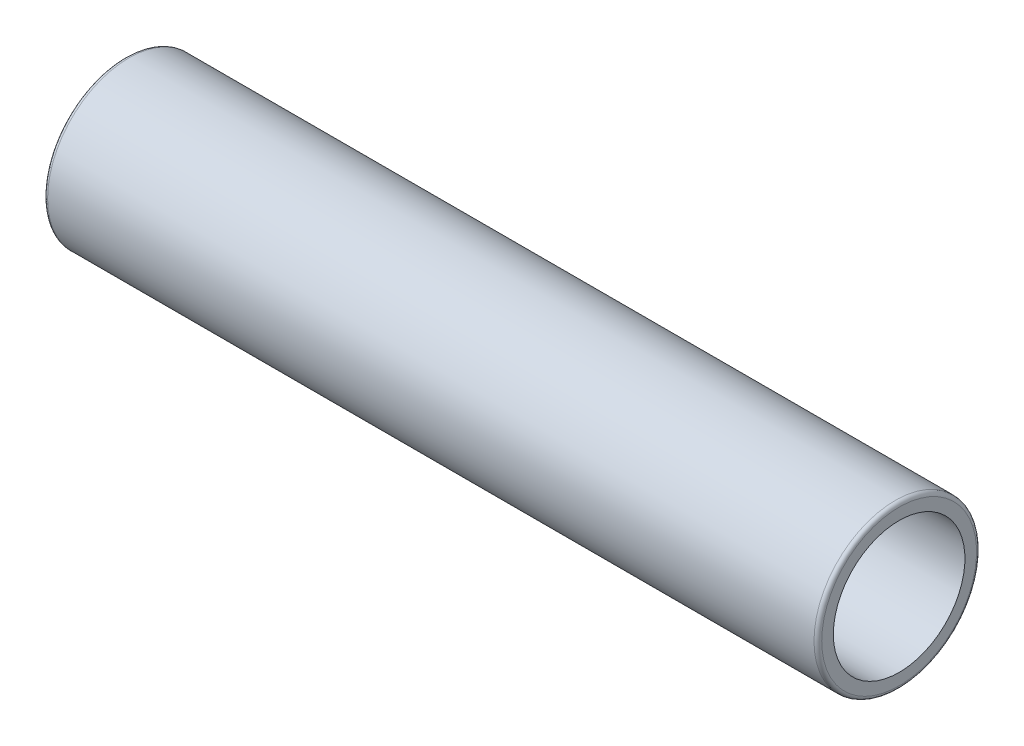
ISO-10303-21;
HEADER;
FILE_DESCRIPTION(('STEP AP214'),'2;1');
FILE_NAME('part.step','',(''),(''),'','','');
FILE_SCHEMA(('AUTOMOTIVE_DESIGN { 1 0 10303 214 1 1 1 1 }'));
ENDSEC;
DATA;
#1=APPLICATION_CONTEXT('core data for automotive mechanical design processes');
#2=APPLICATION_PROTOCOL_DEFINITION('international standard','automotive_design',2000,#1);
#3=PRODUCT_CONTEXT('',#1,'mechanical');
#4=PRODUCT('Part','Part','',(#3));
#5=PRODUCT_RELATED_PRODUCT_CATEGORY('part','',(#4));
#6=PRODUCT_DEFINITION_FORMATION('','',#4);
#7=PRODUCT_DEFINITION_CONTEXT('part definition',#1,'design');
#8=PRODUCT_DEFINITION('design','',#6,#7);
#9=PRODUCT_DEFINITION_SHAPE('','',#8);
#10=(LENGTH_UNIT() NAMED_UNIT(*) SI_UNIT(.MILLI.,.METRE.));
#11=(NAMED_UNIT(*) PLANE_ANGLE_UNIT() SI_UNIT($,.RADIAN.));
#12=(NAMED_UNIT(*) SI_UNIT($,.STERADIAN.) SOLID_ANGLE_UNIT());
#13=UNCERTAINTY_MEASURE_WITH_UNIT(LENGTH_MEASURE(1.E-05),#10,'distance_accuracy_value','');
#14=(GEOMETRIC_REPRESENTATION_CONTEXT(3) GLOBAL_UNCERTAINTY_ASSIGNED_CONTEXT((#13)) GLOBAL_UNIT_ASSIGNED_CONTEXT((#10,
#11,#12)) REPRESENTATION_CONTEXT('',''));
#15=CARTESIAN_POINT('',(0.,0.,0.));
#16=DIRECTION('',(0.,0.,1.));
#17=DIRECTION('',(1.,0.,0.));
#18=AXIS2_PLACEMENT_3D('',#15,#16,#17);
#19=CARTESIAN_POINT('',(0.,0.,0.));
#20=DIRECTION('',(-1.,0.,0.));
#21=DIRECTION('',(0.,0.,1.));
#22=AXIS2_PLACEMENT_3D('',#19,#20,#21);
#23=CYLINDRICAL_SURFACE('',#22,6.);
#24=CARTESIAN_POINT('',(1.9999999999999,0.,0.));
#25=DIRECTION('',(-1.,0.,0.));
#26=DIRECTION('',(0.,0.,1.));
#27=AXIS2_PLACEMENT_3D('',#24,#25,#26);
#28=CIRCLE('',#27,6.);
#29=CARTESIAN_POINT('',(1.9999999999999,0.,6.));
#30=VERTEX_POINT('',#29);
#31=EDGE_CURVE('E43',#30,#30,#28,.T.);
#32=ORIENTED_EDGE('',*,*,#31,.F.);
#33=EDGE_LOOP('',(#32));
#34=FACE_BOUND('',#33,.T.);
#35=CARTESIAN_POINT('',(0.,0.,0.));
#36=DIRECTION('',(-1.,0.,0.));
#37=DIRECTION('',(0.,0.,1.));
#38=AXIS2_PLACEMENT_3D('',#35,#36,#37);
#39=CIRCLE('',#38,6.);
#40=CARTESIAN_POINT('',(0.,0.,6.));
#41=VERTEX_POINT('',#40);
#42=EDGE_CURVE('E34',#41,#41,#39,.T.);
#43=ORIENTED_EDGE('',*,*,#42,.T.);
#44=EDGE_LOOP('',(#43));
#45=FACE_BOUND('',#44,.T.);
#46=ADVANCED_FACE('F14',(#34,#45),#23,.F.);
#47=CARTESIAN_POINT('',(0.,6.,0.));
#48=DIRECTION('',(1.,0.,0.));
#49=DIRECTION('',(0.,0.,-1.));
#50=AXIS2_PLACEMENT_3D('',#47,#48,#49);
#51=PLANE('',#50);
#52=CARTESIAN_POINT('',(0.,0.,0.));
#53=DIRECTION('',(1.,0.,0.));
#54=DIRECTION('',(0.,0.,-1.));
#55=AXIS2_PLACEMENT_3D('',#52,#53,#54);
#56=CIRCLE('',#55,20.);
#57=CARTESIAN_POINT('',(0.,0.,-20.));
#58=VERTEX_POINT('',#57);
#59=EDGE_CURVE('E21',#58,#58,#56,.F.);
#60=ORIENTED_EDGE('',*,*,#59,.T.);
#61=EDGE_LOOP('',(#60));
#62=FACE_BOUND('',#61,.T.);
#63=ORIENTED_EDGE('',*,*,#42,.F.);
#64=EDGE_LOOP('',(#63));
#65=FACE_BOUND('',#64,.T.);
#66=ADVANCED_FACE('F51',(#62,#65),#51,.F.);
#67=CARTESIAN_POINT('',(0.,0.,0.));
#68=DIRECTION('',(-1.,0.,0.));
#69=DIRECTION('',(0.,0.,1.));
#70=AXIS2_PLACEMENT_3D('',#67,#68,#69);
#71=CYLINDRICAL_SURFACE('',#70,21.);
#72=CARTESIAN_POINT('',(1.,0.,0.));
#73=DIRECTION('',(1.,0.,0.));
#74=DIRECTION('',(0.,0.,-1.));
#75=AXIS2_PLACEMENT_3D('',#72,#73,#74);
#76=CIRCLE('',#75,21.);
#77=CARTESIAN_POINT('',(1.,0.,-21.));
#78=VERTEX_POINT('',#77);
#79=EDGE_CURVE('E9',#78,#78,#76,.T.);
#80=ORIENTED_EDGE('',*,*,#79,.T.);
#81=EDGE_LOOP('',(#80));
#82=FACE_BOUND('',#81,.T.);
#83=CARTESIAN_POINT('',(199.,0.,0.));
#84=DIRECTION('',(-1.,0.,0.));
#85=DIRECTION('',(0.,0.,1.));
#86=AXIS2_PLACEMENT_3D('',#83,#84,#85);
#87=CIRCLE('',#86,21.);
#88=CARTESIAN_POINT('',(199.,0.,21.));
#89=VERTEX_POINT('',#88);
#90=EDGE_CURVE('E29',#89,#89,#87,.T.);
#91=ORIENTED_EDGE('',*,*,#90,.T.);
#92=EDGE_LOOP('',(#91));
#93=FACE_BOUND('',#92,.T.);
#94=ADVANCED_FACE('F56',(#82,#93),#71,.T.);
#95=CARTESIAN_POINT('',(200.,21.,0.));
#96=DIRECTION('',(-1.,0.,0.));
#97=DIRECTION('',(0.,0.,1.));
#98=AXIS2_PLACEMENT_3D('',#95,#96,#97);
#99=PLANE('',#98);
#100=CARTESIAN_POINT('',(200.,0.,0.));
#101=DIRECTION('',(-1.,0.,0.));
#102=DIRECTION('',(0.,0.,1.));
#103=AXIS2_PLACEMENT_3D('',#100,#101,#102);
#104=CIRCLE('',#103,20.);
#105=CARTESIAN_POINT('',(200.,0.,20.));
#106=VERTEX_POINT('',#105);
#107=EDGE_CURVE('E25',#106,#106,#104,.F.);
#108=ORIENTED_EDGE('',*,*,#107,.T.);
#109=EDGE_LOOP('',(#108));
#110=FACE_BOUND('',#109,.T.);
#111=CARTESIAN_POINT('',(200.,0.,0.));
#112=DIRECTION('',(-1.,0.,0.));
#113=DIRECTION('',(0.,0.,1.));
#114=AXIS2_PLACEMENT_3D('',#111,#112,#113);
#115=CIRCLE('',#114,17.);
#116=CARTESIAN_POINT('',(200.,0.,17.));
#117=VERTEX_POINT('',#116);
#118=EDGE_CURVE('E37',#117,#117,#115,.T.);
#119=ORIENTED_EDGE('',*,*,#118,.T.);
#120=EDGE_LOOP('',(#119));
#121=FACE_BOUND('',#120,.T.);
#122=ADVANCED_FACE('F63',(#110,#121),#99,.F.);
#123=CARTESIAN_POINT('',(0.,0.,0.));
#124=DIRECTION('',(-1.,0.,0.));
#125=DIRECTION('',(0.,0.,1.));
#126=AXIS2_PLACEMENT_3D('',#123,#124,#125);
#127=CYLINDRICAL_SURFACE('',#126,17.);
#128=ORIENTED_EDGE('',*,*,#118,.F.);
#129=EDGE_LOOP('',(#128));
#130=FACE_BOUND('',#129,.T.);
#131=CARTESIAN_POINT('',(13.,0.,0.));
#132=DIRECTION('',(-1.,0.,0.));
#133=DIRECTION('',(0.,0.,1.));
#134=AXIS2_PLACEMENT_3D('',#131,#132,#133);
#135=CIRCLE('',#134,17.);
#136=CARTESIAN_POINT('',(13.,0.,17.));
#137=VERTEX_POINT('',#136);
#138=EDGE_CURVE('E40',#137,#137,#135,.T.);
#139=ORIENTED_EDGE('',*,*,#138,.T.);
#140=EDGE_LOOP('',(#139));
#141=FACE_BOUND('',#140,.T.);
#142=ADVANCED_FACE('F75',(#130,#141),#127,.F.);
#143=CARTESIAN_POINT('',(1.9999999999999,0.,0.));
#144=DIRECTION('',(1.,0.,0.));
#145=DIRECTION('',(0.,0.,-1.));
#146=AXIS2_PLACEMENT_3D('',#143,#144,#145);
#147=CONICAL_SURFACE('',#146,6.,0.785398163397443);
#148=ORIENTED_EDGE('',*,*,#138,.F.);
#149=EDGE_LOOP('',(#148));
#150=FACE_BOUND('',#149,.T.);
#151=ORIENTED_EDGE('',*,*,#31,.T.);
#152=EDGE_LOOP('',(#151));
#153=FACE_BOUND('',#152,.T.);
#154=ADVANCED_FACE('F47',(#150,#153),#147,.F.);
#155=CARTESIAN_POINT('',(199.,0.,0.));
#156=DIRECTION('',(-1.,0.,0.));
#157=DIRECTION('',(0.,0.,1.));
#158=AXIS2_PLACEMENT_3D('',#155,#156,#157);
#159=TOROIDAL_SURFACE('',#158,20.,1.);
#160=ORIENTED_EDGE('',*,*,#107,.F.);
#161=EDGE_LOOP('',(#160));
#162=FACE_BOUND('',#161,.T.);
#163=ORIENTED_EDGE('',*,*,#90,.F.);
#164=EDGE_LOOP('',(#163));
#165=FACE_BOUND('',#164,.T.);
#166=ADVANCED_FACE('F66',(#162,#165),#159,.T.);
#167=CARTESIAN_POINT('',(1.,0.,0.));
#168=DIRECTION('',(1.,0.,0.));
#169=DIRECTION('',(0.,0.,-1.));
#170=AXIS2_PLACEMENT_3D('',#167,#168,#169);
#171=TOROIDAL_SURFACE('',#170,20.,1.);
#172=ORIENTED_EDGE('',*,*,#79,.F.);
#173=EDGE_LOOP('',(#172));
#174=FACE_BOUND('',#173,.T.);
#175=ORIENTED_EDGE('',*,*,#59,.F.);
#176=EDGE_LOOP('',(#175));
#177=FACE_BOUND('',#176,.T.);
#178=ADVANCED_FACE('F16',(#174,#177),#171,.T.);
#179=CLOSED_SHELL('',(#46,#66,#94,#122,#142,#154,#166,#178));
#180=MANIFOLD_SOLID_BREP('B1',#179);
#181=ADVANCED_BREP_SHAPE_REPRESENTATION('',(#18,#180),#14);
#182=SHAPE_DEFINITION_REPRESENTATION(#9,#181);
ENDSEC;
END-ISO-10303-21;
